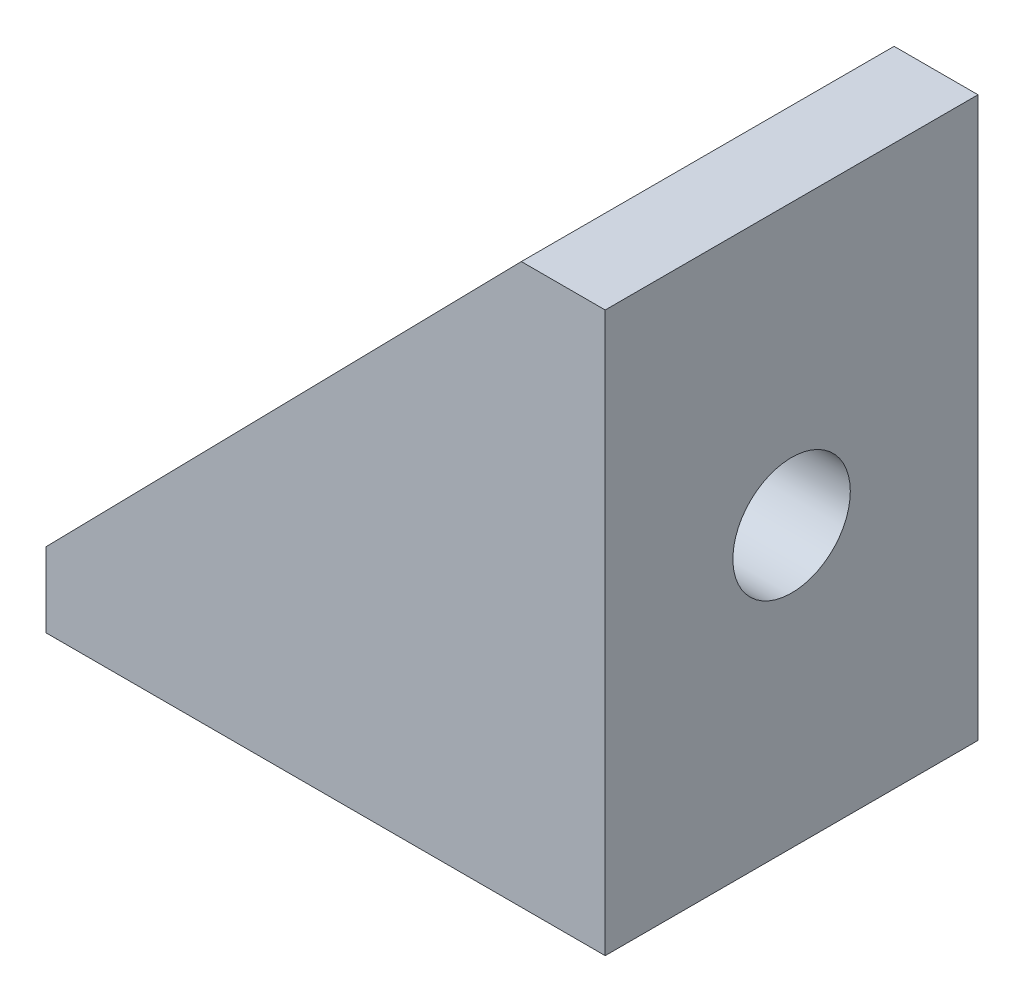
ISO-10303-21;
HEADER;
FILE_DESCRIPTION(('STEP AP214'),'2;1');
FILE_NAME('part.step','',(''),(''),'','','');
FILE_SCHEMA(('AUTOMOTIVE_DESIGN { 1 0 10303 214 1 1 1 1 }'));
ENDSEC;
DATA;
#1=APPLICATION_CONTEXT('core data for automotive mechanical design processes');
#2=APPLICATION_PROTOCOL_DEFINITION('international standard','automotive_design',2000,#1);
#3=PRODUCT_CONTEXT('',#1,'mechanical');
#4=PRODUCT('Part','Part','',(#3));
#5=PRODUCT_RELATED_PRODUCT_CATEGORY('part','',(#4));
#6=PRODUCT_DEFINITION_FORMATION('','',#4);
#7=PRODUCT_DEFINITION_CONTEXT('part definition',#1,'design');
#8=PRODUCT_DEFINITION('design','',#6,#7);
#9=PRODUCT_DEFINITION_SHAPE('','',#8);
#10=(LENGTH_UNIT() NAMED_UNIT(*) SI_UNIT(.MILLI.,.METRE.));
#11=(NAMED_UNIT(*) PLANE_ANGLE_UNIT() SI_UNIT($,.RADIAN.));
#12=(NAMED_UNIT(*) SI_UNIT($,.STERADIAN.) SOLID_ANGLE_UNIT());
#13=UNCERTAINTY_MEASURE_WITH_UNIT(LENGTH_MEASURE(1.E-05),#10,'distance_accuracy_value','');
#14=(GEOMETRIC_REPRESENTATION_CONTEXT(3) GLOBAL_UNCERTAINTY_ASSIGNED_CONTEXT((#13)) GLOBAL_UNIT_ASSIGNED_CONTEXT((#10,
#11,#12)) REPRESENTATION_CONTEXT('',''));
#15=CARTESIAN_POINT('',(0.,0.,0.));
#16=DIRECTION('',(0.,0.,1.));
#17=DIRECTION('',(1.,0.,0.));
#18=AXIS2_PLACEMENT_3D('',#15,#16,#17);
#19=CARTESIAN_POINT('',(25.5,30.,20.));
#20=DIRECTION('',(0.713938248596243,-0.700208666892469,0.));
#21=DIRECTION('',(0.700208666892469,0.713938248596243,0.));
#22=AXIS2_PLACEMENT_3D('',#19,#20,#21);
#23=PLANE('',#22);
#24=DIRECTION('',(0.,0.,-1.));
#25=VECTOR('',#24,1.);
#26=CARTESIAN_POINT('',(25.5,30.,20.));
#27=LINE('',#26,#25);
#28=CARTESIAN_POINT('',(25.5,30.,20.));
#29=VERTEX_POINT('',#28);
#30=CARTESIAN_POINT('',(25.5,30.,17.));
#31=VERTEX_POINT('',#30);
#32=EDGE_CURVE('E115',#29,#31,#27,.T.);
#33=ORIENTED_EDGE('',*,*,#32,.T.);
#34=DIRECTION('',(-0.700208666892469,-0.713938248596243,0.));
#35=VECTOR('',#34,1.);
#36=CARTESIAN_POINT('',(25.5,30.,17.));
#37=LINE('',#36,#35);
#38=CARTESIAN_POINT('',(0.,3.99999999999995,17.));
#39=VERTEX_POINT('',#38);
#40=EDGE_CURVE('E11',#31,#39,#37,.T.);
#41=ORIENTED_EDGE('',*,*,#40,.T.);
#42=DIRECTION('',(0.,0.,-1.));
#43=VECTOR('',#42,1.);
#44=CARTESIAN_POINT('',(0.,4.,20.));
#45=LINE('',#44,#43);
#46=CARTESIAN_POINT('',(0.,4.,20.));
#47=VERTEX_POINT('',#46);
#48=EDGE_CURVE('E134',#47,#39,#45,.T.);
#49=ORIENTED_EDGE('',*,*,#48,.F.);
#50=DIRECTION('',(-0.700208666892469,-0.713938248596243,0.));
#51=VECTOR('',#50,1.);
#52=CARTESIAN_POINT('',(25.5,30.,20.));
#53=LINE('',#52,#51);
#54=EDGE_CURVE('E57',#29,#47,#53,.T.);
#55=ORIENTED_EDGE('',*,*,#54,.F.);
#56=EDGE_LOOP('',(#33,#41,#49,#55));
#57=FACE_BOUND('',#56,.T.);
#58=ADVANCED_FACE('F31',(#57),#23,.F.);
#59=CARTESIAN_POINT('',(0.,4.,20.));
#60=DIRECTION('',(1.,0.,0.));
#61=DIRECTION('',(0.,1.,0.));
#62=AXIS2_PLACEMENT_3D('',#59,#60,#61);
#63=PLANE('',#62);
#64=DIRECTION('',(0.,-1.,0.));
#65=VECTOR('',#64,1.);
#66=CARTESIAN_POINT('',(0.,4.,0.));
#67=LINE('',#66,#65);
#68=CARTESIAN_POINT('',(0.,4.,0.));
#69=VERTEX_POINT('',#68);
#70=CARTESIAN_POINT('',(0.,0.,0.));
#71=VERTEX_POINT('',#70);
#72=EDGE_CURVE('E124',#69,#71,#67,.T.);
#73=ORIENTED_EDGE('',*,*,#72,.T.);
#74=DIRECTION('',(0.,0.,-1.));
#75=VECTOR('',#74,1.);
#76=CARTESIAN_POINT('',(0.,0.,20.));
#77=LINE('',#76,#75);
#78=CARTESIAN_POINT('',(0.,0.,20.));
#79=VERTEX_POINT('',#78);
#80=EDGE_CURVE('E141',#79,#71,#77,.T.);
#81=ORIENTED_EDGE('',*,*,#80,.F.);
#82=DIRECTION('',(0.,-1.,0.));
#83=VECTOR('',#82,1.);
#84=CARTESIAN_POINT('',(0.,4.,20.));
#85=LINE('',#84,#83);
#86=EDGE_CURVE('E133',#47,#79,#85,.T.);
#87=ORIENTED_EDGE('',*,*,#86,.F.);
#88=ORIENTED_EDGE('',*,*,#48,.T.);
#89=CARTESIAN_POINT('',(0.,3.99999999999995,3.));
#90=VERTEX_POINT('',#89);
#91=EDGE_CURVE('E138',#39,#90,#45,.T.);
#92=ORIENTED_EDGE('',*,*,#91,.T.);
#93=EDGE_CURVE('E82',#90,#69,#45,.T.);
#94=ORIENTED_EDGE('',*,*,#93,.T.);
#95=EDGE_LOOP('',(#73,#81,#87,#88,#92,#94));
#96=FACE_BOUND('',#95,.T.);
#97=ADVANCED_FACE('F33',(#96),#63,.F.);
#98=CARTESIAN_POINT('',(0.,0.,20.));
#99=DIRECTION('',(0.,1.,0.));
#100=DIRECTION('',(0.,0.,1.));
#101=AXIS2_PLACEMENT_3D('',#98,#99,#100);
#102=PLANE('',#101);
#103=CARTESIAN_POINT('',(12.,0.,10.));
#104=DIRECTION('',(0.,-1.,0.));
#105=DIRECTION('',(0.,0.,-1.));
#106=AXIS2_PLACEMENT_3D('',#103,#104,#105);
#107=CIRCLE('',#106,3.15);
#108=CARTESIAN_POINT('',(12.,0.,6.85));
#109=VERTEX_POINT('',#108);
#110=EDGE_CURVE('E157',#109,#109,#107,.T.);
#111=ORIENTED_EDGE('',*,*,#110,.F.);
#112=EDGE_LOOP('',(#111));
#113=FACE_BOUND('',#112,.T.);
#114=DIRECTION('',(1.,0.,0.));
#115=VECTOR('',#114,1.);
#116=CARTESIAN_POINT('',(0.,0.,0.));
#117=LINE('',#116,#115);
#118=CARTESIAN_POINT('',(30.,0.,0.));
#119=VERTEX_POINT('',#118);
#120=EDGE_CURVE('E126',#71,#119,#117,.T.);
#121=ORIENTED_EDGE('',*,*,#120,.T.);
#122=DIRECTION('',(0.,0.,-1.));
#123=VECTOR('',#122,1.);
#124=CARTESIAN_POINT('',(30.,0.,20.));
#125=LINE('',#124,#123);
#126=CARTESIAN_POINT('',(30.,0.,20.));
#127=VERTEX_POINT('',#126);
#128=EDGE_CURVE('E114',#127,#119,#125,.T.);
#129=ORIENTED_EDGE('',*,*,#128,.F.);
#130=DIRECTION('',(1.,0.,0.));
#131=VECTOR('',#130,1.);
#132=CARTESIAN_POINT('',(0.,0.,20.));
#133=LINE('',#132,#131);
#134=EDGE_CURVE('E91',#79,#127,#133,.T.);
#135=ORIENTED_EDGE('',*,*,#134,.F.);
#136=ORIENTED_EDGE('',*,*,#80,.T.);
#137=EDGE_LOOP('',(#121,#129,#135,#136));
#138=FACE_BOUND('',#137,.T.);
#139=ADVANCED_FACE('F175',(#113,#138),#102,.F.);
#140=CARTESIAN_POINT('',(30.,0.,20.));
#141=DIRECTION('',(-1.,0.,0.));
#142=DIRECTION('',(0.,0.,1.));
#143=AXIS2_PLACEMENT_3D('',#140,#141,#142);
#144=PLANE('',#143);
#145=CARTESIAN_POINT('',(30.,15.,10.));
#146=DIRECTION('',(1.,0.,0.));
#147=DIRECTION('',(0.,0.,-1.));
#148=AXIS2_PLACEMENT_3D('',#145,#146,#147);
#149=CIRCLE('',#148,3.15);
#150=CARTESIAN_POINT('',(30.,15.,6.85));
#151=VERTEX_POINT('',#150);
#152=EDGE_CURVE('E147',#151,#151,#149,.T.);
#153=ORIENTED_EDGE('',*,*,#152,.F.);
#154=EDGE_LOOP('',(#153));
#155=FACE_BOUND('',#154,.T.);
#156=DIRECTION('',(0.,1.,0.));
#157=VECTOR('',#156,1.);
#158=CARTESIAN_POINT('',(30.,0.,0.));
#159=LINE('',#158,#157);
#160=CARTESIAN_POINT('',(30.,30.,0.));
#161=VERTEX_POINT('',#160);
#162=EDGE_CURVE('E110',#119,#161,#159,.T.);
#163=ORIENTED_EDGE('',*,*,#162,.T.);
#164=DIRECTION('',(0.,0.,-1.));
#165=VECTOR('',#164,1.);
#166=CARTESIAN_POINT('',(30.,30.,20.));
#167=LINE('',#166,#165);
#168=CARTESIAN_POINT('',(30.,30.,20.));
#169=VERTEX_POINT('',#168);
#170=EDGE_CURVE('E107',#169,#161,#167,.T.);
#171=ORIENTED_EDGE('',*,*,#170,.F.);
#172=DIRECTION('',(0.,1.,0.));
#173=VECTOR('',#172,1.);
#174=CARTESIAN_POINT('',(30.,0.,20.));
#175=LINE('',#174,#173);
#176=EDGE_CURVE('E97',#127,#169,#175,.T.);
#177=ORIENTED_EDGE('',*,*,#176,.F.);
#178=ORIENTED_EDGE('',*,*,#128,.T.);
#179=EDGE_LOOP('',(#163,#171,#177,#178));
#180=FACE_BOUND('',#179,.T.);
#181=ADVANCED_FACE('F108',(#155,#180),#144,.F.);
#182=CARTESIAN_POINT('',(30.,30.,20.));
#183=DIRECTION('',(0.,-1.,0.));
#184=DIRECTION('',(1.,0.,0.));
#185=AXIS2_PLACEMENT_3D('',#182,#183,#184);
#186=PLANE('',#185);
#187=DIRECTION('',(-1.,0.,0.));
#188=VECTOR('',#187,1.);
#189=CARTESIAN_POINT('',(30.,30.,0.));
#190=LINE('',#189,#188);
#191=CARTESIAN_POINT('',(25.5,30.,0.));
#192=VERTEX_POINT('',#191);
#193=EDGE_CURVE('E129',#161,#192,#190,.T.);
#194=ORIENTED_EDGE('',*,*,#193,.T.);
#195=CARTESIAN_POINT('',(25.5,30.,3.));
#196=VERTEX_POINT('',#195);
#197=EDGE_CURVE('E137',#196,#192,#27,.T.);
#198=ORIENTED_EDGE('',*,*,#197,.F.);
#199=DIRECTION('',(0.,0.,-1.));
#200=VECTOR('',#199,1.);
#201=CARTESIAN_POINT('',(25.5,30.,3.));
#202=LINE('',#201,#200);
#203=EDGE_CURVE('E146',#31,#196,#202,.T.);
#204=ORIENTED_EDGE('',*,*,#203,.F.);
#205=ORIENTED_EDGE('',*,*,#32,.F.);
#206=DIRECTION('',(-1.,0.,0.));
#207=VECTOR('',#206,1.);
#208=CARTESIAN_POINT('',(30.,30.,20.));
#209=LINE('',#208,#207);
#210=EDGE_CURVE('E101',#169,#29,#209,.T.);
#211=ORIENTED_EDGE('',*,*,#210,.F.);
#212=ORIENTED_EDGE('',*,*,#170,.T.);
#213=EDGE_LOOP('',(#194,#198,#204,#205,#211,#212));
#214=FACE_BOUND('',#213,.T.);
#215=ADVANCED_FACE('F117',(#214),#186,.F.);
#216=ORIENTED_EDGE('',*,*,#93,.F.);
#217=DIRECTION('',(0.700208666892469,0.713938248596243,0.));
#218=VECTOR('',#217,1.);
#219=CARTESIAN_POINT('',(25.5,30.,3.));
#220=LINE('',#219,#218);
#221=EDGE_CURVE('E40',#90,#196,#220,.T.);
#222=ORIENTED_EDGE('',*,*,#221,.T.);
#223=ORIENTED_EDGE('',*,*,#197,.T.);
#224=DIRECTION('',(-0.700208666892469,-0.713938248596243,0.));
#225=VECTOR('',#224,1.);
#226=CARTESIAN_POINT('',(25.5,30.,0.));
#227=LINE('',#226,#225);
#228=EDGE_CURVE('E131',#192,#69,#227,.T.);
#229=ORIENTED_EDGE('',*,*,#228,.T.);
#230=EDGE_LOOP('',(#216,#222,#223,#229));
#231=FACE_BOUND('',#230,.T.);
#232=ADVANCED_FACE('F184',(#231),#23,.F.);
#233=CARTESIAN_POINT('',(0.,0.,20.));
#234=DIRECTION('',(0.,0.,1.));
#235=DIRECTION('',(1.,0.,0.));
#236=AXIS2_PLACEMENT_3D('',#233,#234,#235);
#237=PLANE('',#236);
#238=ORIENTED_EDGE('',*,*,#86,.T.);
#239=ORIENTED_EDGE('',*,*,#134,.T.);
#240=ORIENTED_EDGE('',*,*,#176,.T.);
#241=ORIENTED_EDGE('',*,*,#210,.T.);
#242=ORIENTED_EDGE('',*,*,#54,.T.);
#243=EDGE_LOOP('',(#238,#239,#240,#241,#242));
#244=FACE_BOUND('',#243,.T.);
#245=ADVANCED_FACE('F99',(#244),#237,.T.);
#246=CARTESIAN_POINT('',(0.,0.,0.));
#247=DIRECTION('',(0.,0.,1.));
#248=DIRECTION('',(1.,0.,0.));
#249=AXIS2_PLACEMENT_3D('',#246,#247,#248);
#250=PLANE('',#249);
#251=ORIENTED_EDGE('',*,*,#72,.F.);
#252=ORIENTED_EDGE('',*,*,#228,.F.);
#253=ORIENTED_EDGE('',*,*,#193,.F.);
#254=ORIENTED_EDGE('',*,*,#162,.F.);
#255=ORIENTED_EDGE('',*,*,#120,.F.);
#256=EDGE_LOOP('',(#251,#252,#253,#254,#255));
#257=FACE_BOUND('',#256,.T.);
#258=ADVANCED_FACE('F177',(#257),#250,.F.);
#259=CARTESIAN_POINT('',(-6.35869834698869,3.99999999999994,17.));
#260=DIRECTION('',(0.,0.,1.));
#261=DIRECTION('',(1.,0.,0.));
#262=AXIS2_PLACEMENT_3D('',#259,#260,#261);
#263=PLANE('',#262);
#264=DIRECTION('',(0.,1.,0.));
#265=VECTOR('',#264,1.);
#266=CARTESIAN_POINT('',(25.5,3.99999999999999,17.));
#267=LINE('',#266,#265);
#268=CARTESIAN_POINT('',(25.5,3.99999999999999,17.));
#269=VERTEX_POINT('',#268);
#270=EDGE_CURVE('E48',#269,#31,#267,.T.);
#271=ORIENTED_EDGE('',*,*,#270,.F.);
#272=DIRECTION('',(1.,0.,0.));
#273=VECTOR('',#272,1.);
#274=CARTESIAN_POINT('',(-6.35869834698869,3.99999999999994,17.));
#275=LINE('',#274,#273);
#276=EDGE_CURVE('E165',#39,#269,#275,.T.);
#277=ORIENTED_EDGE('',*,*,#276,.F.);
#278=ORIENTED_EDGE('',*,*,#40,.F.);
#279=EDGE_LOOP('',(#271,#277,#278));
#280=FACE_BOUND('',#279,.T.);
#281=ADVANCED_FACE('F243',(#280),#263,.F.);
#282=CARTESIAN_POINT('',(-6.35869834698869,3.99999999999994,3.));
#283=DIRECTION('',(0.,0.,-1.));
#284=DIRECTION('',(-1.,0.,0.));
#285=AXIS2_PLACEMENT_3D('',#282,#283,#284);
#286=PLANE('',#285);
#287=DIRECTION('',(-1.,0.,0.));
#288=VECTOR('',#287,1.);
#289=CARTESIAN_POINT('',(-6.35869834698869,3.99999999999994,3.));
#290=LINE('',#289,#288);
#291=CARTESIAN_POINT('',(25.5,3.99999999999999,3.));
#292=VERTEX_POINT('',#291);
#293=EDGE_CURVE('E162',#292,#90,#290,.T.);
#294=ORIENTED_EDGE('',*,*,#293,.F.);
#295=DIRECTION('',(0.,1.,0.));
#296=VECTOR('',#295,1.);
#297=CARTESIAN_POINT('',(25.5,3.99999999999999,3.));
#298=LINE('',#297,#296);
#299=EDGE_CURVE('E167',#292,#196,#298,.T.);
#300=ORIENTED_EDGE('',*,*,#299,.T.);
#301=ORIENTED_EDGE('',*,*,#221,.F.);
#302=EDGE_LOOP('',(#294,#300,#301));
#303=FACE_BOUND('',#302,.T.);
#304=ADVANCED_FACE('F188',(#303),#286,.F.);
#305=CARTESIAN_POINT('',(25.5,3.99999999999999,17.));
#306=DIRECTION('',(0.,1.,0.));
#307=DIRECTION('',(-1.,0.,0.));
#308=AXIS2_PLACEMENT_3D('',#305,#306,#307);
#309=PLANE('',#308);
#310=CARTESIAN_POINT('',(12.,3.99999999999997,10.));
#311=DIRECTION('',(0.,1.,0.));
#312=DIRECTION('',(-1.,0.,0.));
#313=AXIS2_PLACEMENT_3D('',#310,#311,#312);
#314=CIRCLE('',#313,3.15);
#315=CARTESIAN_POINT('',(12.,3.99999999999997,6.85));
#316=VERTEX_POINT('',#315);
#317=EDGE_CURVE('E35',#316,#316,#314,.T.);
#318=ORIENTED_EDGE('',*,*,#317,.F.);
#319=EDGE_LOOP('',(#318));
#320=FACE_BOUND('',#319,.T.);
#321=ORIENTED_EDGE('',*,*,#91,.F.);
#322=ORIENTED_EDGE('',*,*,#276,.T.);
#323=DIRECTION('',(0.,0.,-1.));
#324=VECTOR('',#323,1.);
#325=CARTESIAN_POINT('',(25.5,3.99999999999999,3.));
#326=LINE('',#325,#324);
#327=EDGE_CURVE('E150',#269,#292,#326,.T.);
#328=ORIENTED_EDGE('',*,*,#327,.T.);
#329=ORIENTED_EDGE('',*,*,#293,.T.);
#330=EDGE_LOOP('',(#321,#322,#328,#329));
#331=FACE_BOUND('',#330,.T.);
#332=ADVANCED_FACE('F193',(#320,#331),#309,.T.);
#333=CARTESIAN_POINT('',(25.5,3.99999999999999,3.));
#334=DIRECTION('',(1.,0.,0.));
#335=DIRECTION('',(0.,1.,0.));
#336=AXIS2_PLACEMENT_3D('',#333,#334,#335);
#337=PLANE('',#336);
#338=CARTESIAN_POINT('',(25.5,15.,10.));
#339=DIRECTION('',(1.,0.,0.));
#340=DIRECTION('',(0.,1.,0.));
#341=AXIS2_PLACEMENT_3D('',#338,#339,#340);
#342=CIRCLE('',#341,3.15);
#343=CARTESIAN_POINT('',(25.5,15.,6.85));
#344=VERTEX_POINT('',#343);
#345=EDGE_CURVE('E144',#344,#344,#342,.T.);
#346=ORIENTED_EDGE('',*,*,#345,.T.);
#347=EDGE_LOOP('',(#346));
#348=FACE_BOUND('',#347,.T.);
#349=ORIENTED_EDGE('',*,*,#203,.T.);
#350=ORIENTED_EDGE('',*,*,#299,.F.);
#351=ORIENTED_EDGE('',*,*,#327,.F.);
#352=ORIENTED_EDGE('',*,*,#270,.T.);
#353=EDGE_LOOP('',(#349,#350,#351,#352));
#354=FACE_BOUND('',#353,.T.);
#355=ADVANCED_FACE('F197',(#348,#354),#337,.F.);
#356=CARTESIAN_POINT('',(4.,15.,10.));
#357=DIRECTION('',(1.,0.,0.));
#358=DIRECTION('',(0.,0.,-1.));
#359=AXIS2_PLACEMENT_3D('',#356,#357,#358);
#360=CYLINDRICAL_SURFACE('',#359,3.15);
#361=CARTESIAN_POINT('',(30.,15.,6.85));
#362=CARTESIAN_POINT('',(29.953125,15.,6.85));
#363=CARTESIAN_POINT('',(29.90625,15.,6.85));
#364=CARTESIAN_POINT('',(29.8125,15.,6.85));
#365=CARTESIAN_POINT('',(29.765625,15.,6.85));
#366=CARTESIAN_POINT('',(29.671875,15.,6.85));
#367=CARTESIAN_POINT('',(29.625,15.,6.85));
#368=CARTESIAN_POINT('',(29.53125,15.,6.85));
#369=CARTESIAN_POINT('',(29.484375,15.,6.85));
#370=CARTESIAN_POINT('',(29.390625,15.,6.85));
#371=CARTESIAN_POINT('',(29.34375,15.,6.85));
#372=CARTESIAN_POINT('',(29.25,15.,6.85));
#373=CARTESIAN_POINT('',(29.203125,15.,6.85));
#374=CARTESIAN_POINT('',(29.109375,15.,6.85));
#375=CARTESIAN_POINT('',(29.0625,15.,6.85));
#376=CARTESIAN_POINT('',(28.96875,15.,6.85));
#377=CARTESIAN_POINT('',(28.921875,15.,6.85));
#378=CARTESIAN_POINT('',(28.828125,15.,6.85));
#379=CARTESIAN_POINT('',(28.78125,15.,6.85));
#380=CARTESIAN_POINT('',(28.6875,15.,6.85));
#381=CARTESIAN_POINT('',(28.640625,15.,6.85));
#382=CARTESIAN_POINT('',(28.546875,15.,6.85));
#383=CARTESIAN_POINT('',(28.5,15.,6.85));
#384=CARTESIAN_POINT('',(28.40625,15.,6.85));
#385=CARTESIAN_POINT('',(28.359375,15.,6.85));
#386=CARTESIAN_POINT('',(28.265625,15.,6.85));
#387=CARTESIAN_POINT('',(28.21875,15.,6.85));
#388=CARTESIAN_POINT('',(28.125,15.,6.85));
#389=CARTESIAN_POINT('',(28.078125,15.,6.85));
#390=CARTESIAN_POINT('',(27.984375,15.,6.85));
#391=CARTESIAN_POINT('',(27.9375,15.,6.85));
#392=CARTESIAN_POINT('',(27.84375,15.,6.85));
#393=CARTESIAN_POINT('',(27.796875,15.,6.85));
#394=CARTESIAN_POINT('',(27.703125,15.,6.85));
#395=CARTESIAN_POINT('',(27.65625,15.,6.85));
#396=CARTESIAN_POINT('',(27.5625,15.,6.85));
#397=CARTESIAN_POINT('',(27.515625,15.,6.85));
#398=CARTESIAN_POINT('',(27.421875,15.,6.85));
#399=CARTESIAN_POINT('',(27.375,15.,6.85));
#400=CARTESIAN_POINT('',(27.28125,15.,6.85));
#401=CARTESIAN_POINT('',(27.234375,15.,6.85));
#402=CARTESIAN_POINT('',(27.140625,15.,6.85));
#403=CARTESIAN_POINT('',(27.09375,15.,6.85));
#404=CARTESIAN_POINT('',(27.,15.,6.85));
#405=CARTESIAN_POINT('',(26.953125,15.,6.85));
#406=CARTESIAN_POINT('',(26.859375,15.,6.85));
#407=CARTESIAN_POINT('',(26.8125,15.,6.85));
#408=CARTESIAN_POINT('',(26.71875,15.,6.85));
#409=CARTESIAN_POINT('',(26.671875,15.,6.85));
#410=CARTESIAN_POINT('',(26.578125,15.,6.85));
#411=CARTESIAN_POINT('',(26.53125,15.,6.85));
#412=CARTESIAN_POINT('',(26.4375,15.,6.85));
#413=CARTESIAN_POINT('',(26.390625,15.,6.85));
#414=CARTESIAN_POINT('',(26.296875,15.,6.85));
#415=CARTESIAN_POINT('',(26.25,15.,6.85));
#416=CARTESIAN_POINT('',(26.15625,15.,6.85));
#417=CARTESIAN_POINT('',(26.109375,15.,6.85));
#418=CARTESIAN_POINT('',(26.015625,15.,6.85));
#419=CARTESIAN_POINT('',(25.96875,15.,6.85));
#420=CARTESIAN_POINT('',(25.875,15.,6.85));
#421=CARTESIAN_POINT('',(25.828125,15.,6.85));
#422=CARTESIAN_POINT('',(25.734375,15.,6.85));
#423=CARTESIAN_POINT('',(25.6875,15.,6.85));
#424=CARTESIAN_POINT('',(25.59375,15.,6.85));
#425=CARTESIAN_POINT('',(25.546875,15.,6.85));
#426=CARTESIAN_POINT('',(25.5,15.,6.85));
#427=B_SPLINE_CURVE_WITH_KNOTS('',3,(#361,#362,#363,#364,#365,#366,#367,#368,#369,#370,#371,
#372,#373,#374,#375,#376,#377,#378,#379,#380,#381,#382,#383,#384,#385,#386,#387,#388,#389,#390,
#391,#392,#393,#394,#395,#396,#397,#398,#399,#400,#401,#402,#403,#404,#405,#406,#407,#408,#409,
#410,#411,#412,#413,#414,#415,#416,#417,#418,#419,#420,#421,#422,#423,#424,#425,#426),
.UNSPECIFIED.,.F.,.F.,(4,2,2,2,2,2,2,2,2,2,2,2,2,2,2,2,2,2,2,2,2,2,2,2,2,2,2,2,2,2,2,2,4),(0.,
0.140624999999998,0.281249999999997,0.421874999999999,0.562499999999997,0.703124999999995,
0.843749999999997,0.984374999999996,1.12499999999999,1.26562499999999,1.40624999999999,
1.54687499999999,1.68749999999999,1.82812499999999,1.96874999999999,2.10937499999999,
2.24999999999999,2.39062499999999,2.53124999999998,2.67187499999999,2.81249999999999,
2.95312499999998,3.09374999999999,3.23437499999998,3.37499999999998,3.51562499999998,
3.65624999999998,3.79687499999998,3.93749999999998,4.07812499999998,4.21874999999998,
4.35937499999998,4.49999999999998),.UNSPECIFIED.);
#428=EDGE_CURVE('BSEAM200',#151,#344,#427,.T.);
#429=ORIENTED_EDGE('',*,*,#152,.T.);
#430=ORIENTED_EDGE('',*,*,#345,.F.);
#431=ORIENTED_EDGE('',*,*,#428,.T.);
#432=ORIENTED_EDGE('',*,*,#428,.F.);
#433=EDGE_LOOP('',(#429,#431,#430,#432));
#434=FACE_BOUND('',#433,.T.);
#435=ADVANCED_FACE('F200',(#434),#360,.F.);
#436=CARTESIAN_POINT('',(12.,26.,10.));
#437=DIRECTION('',(0.,-1.,0.));
#438=DIRECTION('',(0.,0.,-1.));
#439=AXIS2_PLACEMENT_3D('',#436,#437,#438);
#440=CYLINDRICAL_SURFACE('',#439,3.15);
#441=CARTESIAN_POINT('',(12.,3.99999999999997,6.85));
#442=CARTESIAN_POINT('',(12.,3.9583333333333,6.85));
#443=CARTESIAN_POINT('',(12.,3.91666666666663,6.85));
#444=CARTESIAN_POINT('',(12.,3.8333333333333,6.85));
#445=CARTESIAN_POINT('',(12.,3.79166666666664,6.85));
#446=CARTESIAN_POINT('',(12.,3.70833333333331,6.85));
#447=CARTESIAN_POINT('',(12.,3.66666666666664,6.85));
#448=CARTESIAN_POINT('',(12.,3.58333333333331,6.85));
#449=CARTESIAN_POINT('',(12.,3.54166666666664,6.85));
#450=CARTESIAN_POINT('',(12.,3.45833333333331,6.85));
#451=CARTESIAN_POINT('',(12.,3.41666666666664,6.85));
#452=CARTESIAN_POINT('',(12.,3.33333333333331,6.85));
#453=CARTESIAN_POINT('',(12.,3.29166666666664,6.85));
#454=CARTESIAN_POINT('',(12.,3.20833333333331,6.85));
#455=CARTESIAN_POINT('',(12.,3.16666666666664,6.85));
#456=CARTESIAN_POINT('',(12.,3.08333333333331,6.85));
#457=CARTESIAN_POINT('',(12.,3.04166666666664,6.85));
#458=CARTESIAN_POINT('',(12.,2.95833333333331,6.85));
#459=CARTESIAN_POINT('',(12.,2.91666666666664,6.85));
#460=CARTESIAN_POINT('',(12.,2.83333333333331,6.85));
#461=CARTESIAN_POINT('',(12.,2.79166666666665,6.85));
#462=CARTESIAN_POINT('',(12.,2.70833333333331,6.85));
#463=CARTESIAN_POINT('',(12.,2.66666666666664,6.85));
#464=CARTESIAN_POINT('',(12.,2.58333333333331,6.85));
#465=CARTESIAN_POINT('',(12.,2.54166666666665,6.85));
#466=CARTESIAN_POINT('',(12.,2.45833333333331,6.85));
#467=CARTESIAN_POINT('',(12.,2.41666666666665,6.85));
#468=CARTESIAN_POINT('',(12.,2.33333333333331,6.85));
#469=CARTESIAN_POINT('',(12.,2.29166666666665,6.85));
#470=CARTESIAN_POINT('',(12.,2.20833333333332,6.85));
#471=CARTESIAN_POINT('',(12.,2.16666666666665,6.85));
#472=CARTESIAN_POINT('',(12.,2.08333333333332,6.85));
#473=CARTESIAN_POINT('',(12.,2.04166666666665,6.85));
#474=CARTESIAN_POINT('',(12.,1.95833333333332,6.85));
#475=CARTESIAN_POINT('',(12.,1.91666666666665,6.85));
#476=CARTESIAN_POINT('',(12.,1.83333333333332,6.85));
#477=CARTESIAN_POINT('',(12.,1.79166666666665,6.85));
#478=CARTESIAN_POINT('',(12.,1.70833333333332,6.85));
#479=CARTESIAN_POINT('',(12.,1.66666666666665,6.85));
#480=CARTESIAN_POINT('',(12.,1.58333333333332,6.85));
#481=CARTESIAN_POINT('',(12.,1.54166666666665,6.85));
#482=CARTESIAN_POINT('',(12.,1.45833333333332,6.85));
#483=CARTESIAN_POINT('',(12.,1.41666666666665,6.85));
#484=CARTESIAN_POINT('',(12.,1.33333333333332,6.85));
#485=CARTESIAN_POINT('',(12.,1.29166666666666,6.85));
#486=CARTESIAN_POINT('',(12.,1.20833333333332,6.85));
#487=CARTESIAN_POINT('',(12.,1.16666666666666,6.85));
#488=CARTESIAN_POINT('',(12.,1.08333333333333,6.85));
#489=CARTESIAN_POINT('',(12.,1.04166666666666,6.85));
#490=CARTESIAN_POINT('',(12.,0.958333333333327,6.85));
#491=CARTESIAN_POINT('',(12.,0.916666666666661,6.85));
#492=CARTESIAN_POINT('',(12.,0.833333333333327,6.85));
#493=CARTESIAN_POINT('',(12.,0.79166666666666,6.85));
#494=CARTESIAN_POINT('',(12.,0.708333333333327,6.85));
#495=CARTESIAN_POINT('',(12.,0.66666666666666,6.85));
#496=CARTESIAN_POINT('',(12.,0.583333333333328,6.85));
#497=CARTESIAN_POINT('',(12.,0.541666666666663,6.85));
#498=CARTESIAN_POINT('',(12.,0.45833333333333,6.85));
#499=CARTESIAN_POINT('',(12.,0.416666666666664,6.85));
#500=CARTESIAN_POINT('',(12.,0.33333333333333,6.85));
#501=CARTESIAN_POINT('',(12.,0.291666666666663,6.85));
#502=CARTESIAN_POINT('',(12.,0.208333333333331,6.85));
#503=CARTESIAN_POINT('',(12.,0.166666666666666,6.85));
#504=CARTESIAN_POINT('',(12.,0.0833333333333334,6.85));
#505=CARTESIAN_POINT('',(12.,0.0416666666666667,6.85));
#506=CARTESIAN_POINT('',(12.,0.,6.85));
#507=B_SPLINE_CURVE_WITH_KNOTS('',3,(#441,#442,#443,#444,#445,#446,#447,#448,#449,#450,#451,
#452,#453,#454,#455,#456,#457,#458,#459,#460,#461,#462,#463,#464,#465,#466,#467,#468,#469,#470,
#471,#472,#473,#474,#475,#476,#477,#478,#479,#480,#481,#482,#483,#484,#485,#486,#487,#488,#489,
#490,#491,#492,#493,#494,#495,#496,#497,#498,#499,#500,#501,#502,#503,#504,#505,#506),
.UNSPECIFIED.,.F.,.F.,(4,2,2,2,2,2,2,2,2,2,2,2,2,2,2,2,2,2,2,2,2,2,2,2,2,2,2,2,2,2,2,2,4),(0.,
0.125,0.249999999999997,0.374999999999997,0.499999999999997,0.624999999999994,0.749999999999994,
0.874999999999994,0.999999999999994,1.12499999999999,1.24999999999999,1.37499999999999,
1.49999999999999,1.62499999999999,1.74999999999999,1.87499999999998,1.99999999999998,
2.12499999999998,2.24999999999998,2.37499999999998,2.49999999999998,2.62499999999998,
2.74999999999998,2.87499999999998,2.99999999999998,3.12499999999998,3.24999999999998,
3.37499999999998,3.49999999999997,3.62499999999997,3.74999999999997,3.87499999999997,
3.99999999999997),.UNSPECIFIED.);
#508=EDGE_CURVE('BSEAM206',#316,#109,#507,.T.);
#509=ORIENTED_EDGE('',*,*,#317,.T.);
#510=ORIENTED_EDGE('',*,*,#110,.T.);
#511=ORIENTED_EDGE('',*,*,#508,.T.);
#512=ORIENTED_EDGE('',*,*,#508,.F.);
#513=EDGE_LOOP('',(#509,#511,#510,#512));
#514=FACE_BOUND('',#513,.T.);
#515=ADVANCED_FACE('F206',(#514),#440,.F.);
#516=CLOSED_SHELL('',(#58,#97,#139,#181,#215,#232,#245,#258,#281,#304,#332,#355,#435,#515));
#517=MANIFOLD_SOLID_BREP('B2',#516);
#518=ADVANCED_BREP_SHAPE_REPRESENTATION('',(#18,#517),#14);
#519=SHAPE_DEFINITION_REPRESENTATION(#9,#518);
ENDSEC;
END-ISO-10303-21;
